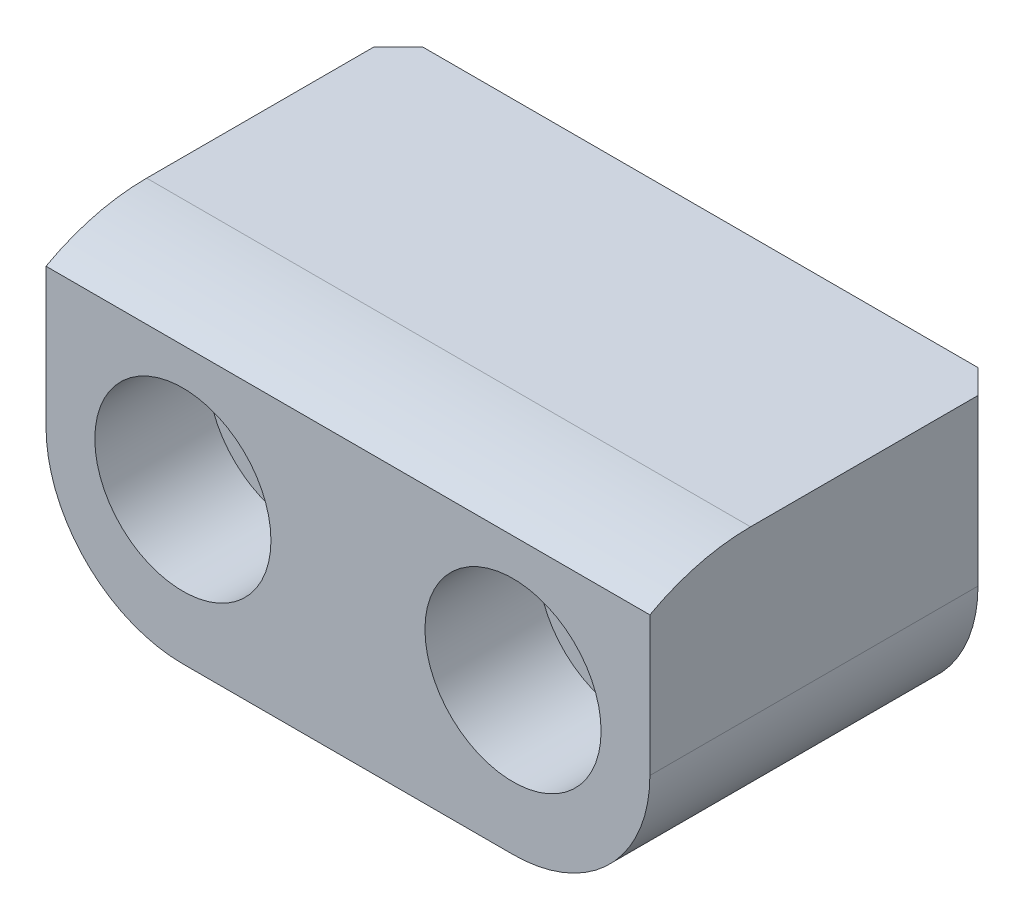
from build123d import *

# Parameters (mm, degrees)
SKETCH3_W                  = 38.1
SKETCH3_H                  = 19.05
EXTRUDE1_DEPTH             = 22.225
FILLET1_R                  = 8.636
F_1_4_20_CBORE_D           = 6.5278
F_1_4_20_CBORE_CBORE_D     = 11.1125
F_1_4_20_CBORE_CBORE_DEPTH = 7.14375
CUT_EXTRUDE1_DEPTH         = 49.046468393
CHAMFER1_SIZE              = 1.524


with BuildPart() as part:
    # Sketch3 → Extrude1 (new body)
    with BuildSketch(Plane.XY):
        with Locations((19.05, -9.525)):
            Rectangle(SKETCH3_W, SKETCH3_H)
    extrude(amount=-EXTRUDE1_DEPTH)

    # Fillet1
    fillet1_edges = [part.edges().sort_by_distance(p)[0] for p in [
        (38.1, -19.05, -11.1125),
        (0, -19.05, -11.1125),
    ]]
    fillet(fillet1_edges, radius=FILLET1_R)

    # 1_4_-20 CBORE (through all)
    with Locations(Plane.XY):
        with Locations((8.636, -9.525), (29.464, -9.525)):
            CounterBoreHole(F_1_4_20_CBORE_D / 2, F_1_4_20_CBORE_CBORE_D / 2, F_1_4_20_CBORE_CBORE_DEPTH)

    # Sketch6 → Cut-Extrude1 (cut, through all)
    with BuildSketch(Plane.ZY):
        with BuildLine():
            Line((-6.35, 0), (-6.35, 5.08))
            Line((-6.35, 5.08), (6.35, 5.08))
            Line((6.35, 5.08), (6.35, -1.636637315))
            Line((6.35, -1.636637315), (0, -1.636637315))
            ThreePointArc((0, -1.636637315), (-3.071239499, -0.415737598), (-6.35, 0))
        make_face()
    extrude(amount=-CUT_EXTRUDE1_DEPTH, mode=Mode.SUBTRACT)

    # Chamfer1
    chamfer1_edges = [part.edges().sort_by_distance(p)[0] for p in [
        (19.05, -19.05, -22.225),
        (38.1, -5.207, -22.225),
        (35.570574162, -16.520574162, -22.225),
        (2.529425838, -16.520574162, -22.225),
        (0, -5.207, -22.225),
    ]]
    chamfer(chamfer1_edges, length=CHAMFER1_SIZE)


solid = part.part
